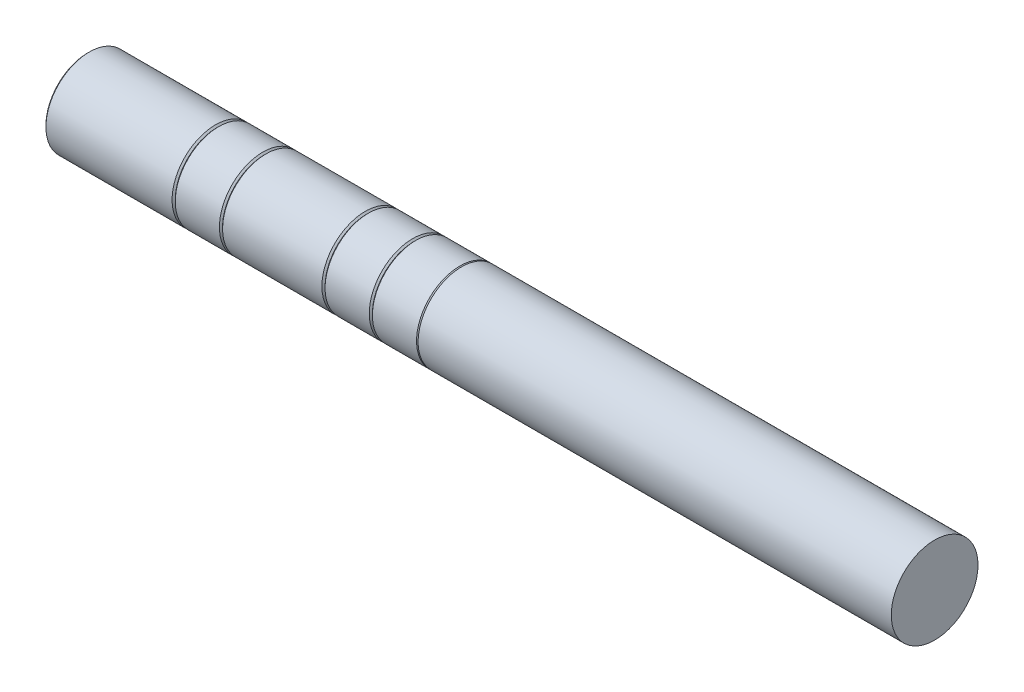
ISO-10303-21;
HEADER;
FILE_DESCRIPTION(('STEP AP214'),'2;1');
FILE_NAME('part.step','',(''),(''),'','','');
FILE_SCHEMA(('AUTOMOTIVE_DESIGN { 1 0 10303 214 1 1 1 1 }'));
ENDSEC;
DATA;
#1=APPLICATION_CONTEXT('core data for automotive mechanical design processes');
#2=APPLICATION_PROTOCOL_DEFINITION('international standard','automotive_design',2000,#1);
#3=PRODUCT_CONTEXT('',#1,'mechanical');
#4=PRODUCT('Part','Part','',(#3));
#5=PRODUCT_RELATED_PRODUCT_CATEGORY('part','',(#4));
#6=PRODUCT_DEFINITION_FORMATION('','',#4);
#7=PRODUCT_DEFINITION_CONTEXT('part definition',#1,'design');
#8=PRODUCT_DEFINITION('design','',#6,#7);
#9=PRODUCT_DEFINITION_SHAPE('','',#8);
#10=(LENGTH_UNIT() NAMED_UNIT(*) SI_UNIT(.MILLI.,.METRE.));
#11=(NAMED_UNIT(*) PLANE_ANGLE_UNIT() SI_UNIT($,.RADIAN.));
#12=(NAMED_UNIT(*) SI_UNIT($,.STERADIAN.) SOLID_ANGLE_UNIT());
#13=UNCERTAINTY_MEASURE_WITH_UNIT(LENGTH_MEASURE(1.E-05),#10,'distance_accuracy_value','');
#14=(GEOMETRIC_REPRESENTATION_CONTEXT(3) GLOBAL_UNCERTAINTY_ASSIGNED_CONTEXT((#13)) GLOBAL_UNIT_ASSIGNED_CONTEXT((#10,
#11,#12)) REPRESENTATION_CONTEXT('',''));
#15=CARTESIAN_POINT('',(0.,0.,0.));
#16=DIRECTION('',(0.,0.,1.));
#17=DIRECTION('',(1.,0.,0.));
#18=AXIS2_PLACEMENT_3D('',#15,#16,#17);
#19=CARTESIAN_POINT('',(8.2,0.,0.));
#20=DIRECTION('',(-1.,0.,0.));
#21=DIRECTION('',(0.,0.,1.));
#22=AXIS2_PLACEMENT_3D('',#19,#20,#21);
#23=CYLINDRICAL_SURFACE('',#22,2.75);
#24=CARTESIAN_POINT('',(0.0999999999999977,0.,0.));
#25=DIRECTION('',(1.,0.,0.));
#26=DIRECTION('',(0.,0.,-1.));
#27=AXIS2_PLACEMENT_3D('',#24,#25,#26);
#28=CIRCLE('',#27,2.75);
#29=CARTESIAN_POINT('',(0.0999999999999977,0.,-2.75));
#30=VERTEX_POINT('',#29);
#31=EDGE_CURVE('E40',#30,#30,#28,.T.);
#32=ORIENTED_EDGE('',*,*,#31,.T.);
#33=EDGE_LOOP('',(#32));
#34=FACE_BOUND('',#33,.T.);
#35=CARTESIAN_POINT('',(8.1,0.,0.));
#36=DIRECTION('',(1.,0.,0.));
#37=DIRECTION('',(0.,0.,-1.));
#38=AXIS2_PLACEMENT_3D('',#35,#36,#37);
#39=CIRCLE('',#38,2.75);
#40=CARTESIAN_POINT('',(8.1,0.,-2.75));
#41=VERTEX_POINT('',#40);
#42=EDGE_CURVE('E83',#41,#41,#39,.F.);
#43=ORIENTED_EDGE('',*,*,#42,.T.);
#44=EDGE_LOOP('',(#43));
#45=FACE_BOUND('',#44,.T.);
#46=ADVANCED_FACE('F33',(#34,#45),#23,.T.);
#47=CARTESIAN_POINT('',(0.,0.,0.));
#48=DIRECTION('',(1.,0.,0.));
#49=DIRECTION('',(0.,0.,-1.));
#50=AXIS2_PLACEMENT_3D('',#47,#48,#49);
#51=PLANE('',#50);
#52=CARTESIAN_POINT('',(0.,0.,0.));
#53=DIRECTION('',(1.,0.,0.));
#54=DIRECTION('',(0.,0.,-1.));
#55=AXIS2_PLACEMENT_3D('',#52,#53,#54);
#56=CIRCLE('',#55,2.65);
#57=CARTESIAN_POINT('',(0.,0.,-2.65));
#58=VERTEX_POINT('',#57);
#59=EDGE_CURVE('E10',#58,#58,#56,.F.);
#60=ORIENTED_EDGE('',*,*,#59,.T.);
#61=EDGE_LOOP('',(#60));
#62=FACE_BOUND('',#61,.T.);
#63=ADVANCED_FACE('F116',(#62),#51,.F.);
#64=CARTESIAN_POINT('',(8.2,0.,0.));
#65=DIRECTION('',(-1.,0.,0.));
#66=DIRECTION('',(0.,0.,1.));
#67=AXIS2_PLACEMENT_3D('',#64,#65,#66);
#68=CONICAL_SURFACE('',#67,2.65,0.785398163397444);
#69=ORIENTED_EDGE('',*,*,#42,.F.);
#70=EDGE_LOOP('',(#69));
#71=FACE_BOUND('',#70,.T.);
#72=CARTESIAN_POINT('',(8.2,0.,0.));
#73=DIRECTION('',(1.,0.,0.));
#74=DIRECTION('',(0.,0.,-1.));
#75=AXIS2_PLACEMENT_3D('',#72,#73,#74);
#76=CIRCLE('',#75,2.65);
#77=CARTESIAN_POINT('',(8.2,0.,-2.65));
#78=VERTEX_POINT('',#77);
#79=EDGE_CURVE('E86',#78,#78,#76,.T.);
#80=ORIENTED_EDGE('',*,*,#79,.F.);
#81=EDGE_LOOP('',(#80));
#82=FACE_BOUND('',#81,.T.);
#83=ADVANCED_FACE('F121',(#71,#82),#68,.T.);
#84=CARTESIAN_POINT('',(11.2,0.,0.));
#85=DIRECTION('',(-1.,0.,0.));
#86=DIRECTION('',(0.,0.,1.));
#87=AXIS2_PLACEMENT_3D('',#84,#85,#86);
#88=CYLINDRICAL_SURFACE('',#87,2.75);
#89=CARTESIAN_POINT('',(8.3,0.,0.));
#90=DIRECTION('',(1.,0.,0.));
#91=DIRECTION('',(0.,0.,-1.));
#92=AXIS2_PLACEMENT_3D('',#89,#90,#91);
#93=CIRCLE('',#92,2.75);
#94=CARTESIAN_POINT('',(8.3,0.,-2.75));
#95=VERTEX_POINT('',#94);
#96=EDGE_CURVE('E77',#95,#95,#93,.T.);
#97=ORIENTED_EDGE('',*,*,#96,.T.);
#98=EDGE_LOOP('',(#97));
#99=FACE_BOUND('',#98,.T.);
#100=CARTESIAN_POINT('',(11.1,0.,0.));
#101=DIRECTION('',(1.,0.,0.));
#102=DIRECTION('',(0.,0.,-1.));
#103=AXIS2_PLACEMENT_3D('',#100,#101,#102);
#104=CIRCLE('',#103,2.75);
#105=CARTESIAN_POINT('',(11.1,0.,-2.75));
#106=VERTEX_POINT('',#105);
#107=EDGE_CURVE('E80',#106,#106,#104,.F.);
#108=ORIENTED_EDGE('',*,*,#107,.T.);
#109=EDGE_LOOP('',(#108));
#110=FACE_BOUND('',#109,.T.);
#111=ADVANCED_FACE('F128',(#99,#110),#88,.T.);
#112=CARTESIAN_POINT('',(8.3,0.,0.));
#113=DIRECTION('',(1.,0.,0.));
#114=DIRECTION('',(0.,0.,-1.));
#115=AXIS2_PLACEMENT_3D('',#112,#113,#114);
#116=CONICAL_SURFACE('',#115,2.75,0.785398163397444);
#117=ORIENTED_EDGE('',*,*,#79,.T.);
#118=EDGE_LOOP('',(#117));
#119=FACE_BOUND('',#118,.T.);
#120=ORIENTED_EDGE('',*,*,#96,.F.);
#121=EDGE_LOOP('',(#120));
#122=FACE_BOUND('',#121,.T.);
#123=ADVANCED_FACE('F130',(#119,#122),#116,.T.);
#124=CARTESIAN_POINT('',(11.2,0.,0.));
#125=DIRECTION('',(-1.,0.,0.));
#126=DIRECTION('',(0.,0.,1.));
#127=AXIS2_PLACEMENT_3D('',#124,#125,#126);
#128=CONICAL_SURFACE('',#127,2.65,0.785398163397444);
#129=ORIENTED_EDGE('',*,*,#107,.F.);
#130=EDGE_LOOP('',(#129));
#131=FACE_BOUND('',#130,.T.);
#132=CARTESIAN_POINT('',(11.2,0.,0.));
#133=DIRECTION('',(1.,0.,0.));
#134=DIRECTION('',(0.,0.,-1.));
#135=AXIS2_PLACEMENT_3D('',#132,#133,#134);
#136=CIRCLE('',#135,2.65);
#137=CARTESIAN_POINT('',(11.2,0.,-2.65));
#138=VERTEX_POINT('',#137);
#139=EDGE_CURVE('E74',#138,#138,#136,.T.);
#140=ORIENTED_EDGE('',*,*,#139,.F.);
#141=EDGE_LOOP('',(#140));
#142=FACE_BOUND('',#141,.T.);
#143=ADVANCED_FACE('F133',(#131,#142),#128,.T.);
#144=CARTESIAN_POINT('',(17.7,0.,0.));
#145=DIRECTION('',(-1.,0.,0.));
#146=DIRECTION('',(0.,0.,1.));
#147=AXIS2_PLACEMENT_3D('',#144,#145,#146);
#148=CYLINDRICAL_SURFACE('',#147,2.75);
#149=CARTESIAN_POINT('',(11.3,0.,0.));
#150=DIRECTION('',(1.,0.,0.));
#151=DIRECTION('',(0.,0.,-1.));
#152=AXIS2_PLACEMENT_3D('',#149,#150,#151);
#153=CIRCLE('',#152,2.75);
#154=CARTESIAN_POINT('',(11.3,0.,2.75));
#155=VERTEX_POINT('',#154);
#156=EDGE_CURVE('E68',#155,#155,#153,.T.);
#157=CARTESIAN_POINT('',(17.6,0.,0.));
#158=DIRECTION('',(1.,0.,0.));
#159=DIRECTION('',(0.,0.,-1.));
#160=AXIS2_PLACEMENT_3D('',#157,#158,#159);
#161=CIRCLE('',#160,2.75);
#162=CARTESIAN_POINT('',(17.6,0.,2.75));
#163=VERTEX_POINT('',#162);
#164=EDGE_CURVE('E71',#163,#163,#161,.F.);
#165=CARTESIAN_POINT('',(11.3,0.,2.75));
#166=CARTESIAN_POINT('',(11.365625,0.,2.75));
#167=CARTESIAN_POINT('',(11.43125,0.,2.75));
#168=CARTESIAN_POINT('',(11.5625,0.,2.75));
#169=CARTESIAN_POINT('',(11.628125,0.,2.75));
#170=CARTESIAN_POINT('',(11.759375,0.,2.75));
#171=CARTESIAN_POINT('',(11.825,0.,2.75));
#172=CARTESIAN_POINT('',(11.95625,0.,2.75));
#173=CARTESIAN_POINT('',(12.021875,0.,2.75));
#174=CARTESIAN_POINT('',(12.153125,0.,2.75));
#175=CARTESIAN_POINT('',(12.21875,0.,2.75));
#176=CARTESIAN_POINT('',(12.35,0.,2.75));
#177=CARTESIAN_POINT('',(12.415625,0.,2.75));
#178=CARTESIAN_POINT('',(12.546875,0.,2.75));
#179=CARTESIAN_POINT('',(12.6125,0.,2.75));
#180=CARTESIAN_POINT('',(12.74375,0.,2.75));
#181=CARTESIAN_POINT('',(12.809375,0.,2.75));
#182=CARTESIAN_POINT('',(12.940625,0.,2.75));
#183=CARTESIAN_POINT('',(13.00625,0.,2.75));
#184=CARTESIAN_POINT('',(13.1375,0.,2.75));
#185=CARTESIAN_POINT('',(13.203125,0.,2.75));
#186=CARTESIAN_POINT('',(13.334375,0.,2.75));
#187=CARTESIAN_POINT('',(13.4,0.,2.75));
#188=CARTESIAN_POINT('',(13.53125,0.,2.75));
#189=CARTESIAN_POINT('',(13.596875,0.,2.75));
#190=CARTESIAN_POINT('',(13.728125,0.,2.75));
#191=CARTESIAN_POINT('',(13.79375,0.,2.75));
#192=CARTESIAN_POINT('',(13.925,0.,2.75));
#193=CARTESIAN_POINT('',(13.990625,0.,2.75));
#194=CARTESIAN_POINT('',(14.121875,0.,2.75));
#195=CARTESIAN_POINT('',(14.1875,0.,2.75));
#196=CARTESIAN_POINT('',(14.31875,0.,2.75));
#197=CARTESIAN_POINT('',(14.384375,0.,2.75));
#198=CARTESIAN_POINT('',(14.515625,0.,2.75));
#199=CARTESIAN_POINT('',(14.58125,0.,2.75));
#200=CARTESIAN_POINT('',(14.7125,0.,2.75));
#201=CARTESIAN_POINT('',(14.778125,0.,2.75));
#202=CARTESIAN_POINT('',(14.909375,0.,2.75));
#203=CARTESIAN_POINT('',(14.975,0.,2.75));
#204=CARTESIAN_POINT('',(15.10625,0.,2.75));
#205=CARTESIAN_POINT('',(15.171875,0.,2.75));
#206=CARTESIAN_POINT('',(15.303125,0.,2.75));
#207=CARTESIAN_POINT('',(15.36875,0.,2.75));
#208=CARTESIAN_POINT('',(15.5,0.,2.75));
#209=CARTESIAN_POINT('',(15.565625,0.,2.75));
#210=CARTESIAN_POINT('',(15.696875,0.,2.75));
#211=CARTESIAN_POINT('',(15.7625,0.,2.75));
#212=CARTESIAN_POINT('',(15.89375,0.,2.75));
#213=CARTESIAN_POINT('',(15.959375,0.,2.75));
#214=CARTESIAN_POINT('',(16.090625,0.,2.75));
#215=CARTESIAN_POINT('',(16.15625,0.,2.75));
#216=CARTESIAN_POINT('',(16.2875,0.,2.75));
#217=CARTESIAN_POINT('',(16.353125,0.,2.75));
#218=CARTESIAN_POINT('',(16.484375,0.,2.75));
#219=CARTESIAN_POINT('',(16.55,0.,2.75));
#220=CARTESIAN_POINT('',(16.68125,0.,2.75));
#221=CARTESIAN_POINT('',(16.746875,0.,2.75));
#222=CARTESIAN_POINT('',(16.878125,0.,2.75));
#223=CARTESIAN_POINT('',(16.94375,0.,2.75));
#224=CARTESIAN_POINT('',(17.075,0.,2.75));
#225=CARTESIAN_POINT('',(17.140625,0.,2.75));
#226=CARTESIAN_POINT('',(17.271875,0.,2.75));
#227=CARTESIAN_POINT('',(17.3375,0.,2.75));
#228=CARTESIAN_POINT('',(17.46875,0.,2.75));
#229=CARTESIAN_POINT('',(17.534375,0.,2.75));
#230=CARTESIAN_POINT('',(17.6,0.,2.75));
#231=B_SPLINE_CURVE_WITH_KNOTS('',3,(#165,#166,#167,#168,#169,#170,#171,#172,#173,#174,#175,
#176,#177,#178,#179,#180,#181,#182,#183,#184,#185,#186,#187,#188,#189,#190,#191,#192,#193,#194,
#195,#196,#197,#198,#199,#200,#201,#202,#203,#204,#205,#206,#207,#208,#209,#210,#211,#212,#213,
#214,#215,#216,#217,#218,#219,#220,#221,#222,#223,#224,#225,#226,#227,#228,#229,#230),
.UNSPECIFIED.,.F.,.F.,(4,2,2,2,2,2,2,2,2,2,2,2,2,2,2,2,2,2,2,2,2,2,2,2,2,2,2,2,2,2,2,2,4),(0.,
0.196875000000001,0.393750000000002,0.590625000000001,0.7875,0.984374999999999,1.18125,1.378125,
1.575,1.771875,1.96875,2.165625,2.3625,2.559375,2.75625,2.953125,3.15,3.346875,3.54375,3.740625,
3.9375,4.134375,4.33125,4.528125,4.725,4.921875,5.11875,5.315625,5.5125,5.709375,
5.90624999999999,6.10312499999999,6.3),.UNSPECIFIED.);
#232=EDGE_CURVE('BSEAM137',#155,#163,#231,.T.);
#233=ORIENTED_EDGE('',*,*,#156,.T.);
#234=ORIENTED_EDGE('',*,*,#164,.T.);
#235=ORIENTED_EDGE('',*,*,#232,.T.);
#236=ORIENTED_EDGE('',*,*,#232,.F.);
#237=EDGE_LOOP('',(#233,#235,#234,#236));
#238=FACE_BOUND('',#237,.T.);
#239=ADVANCED_FACE('F137',(#238),#148,.T.);
#240=CARTESIAN_POINT('',(11.3,0.,0.));
#241=DIRECTION('',(1.,0.,0.));
#242=DIRECTION('',(0.,0.,-1.));
#243=AXIS2_PLACEMENT_3D('',#240,#241,#242);
#244=CONICAL_SURFACE('',#243,2.75,0.785398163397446);
#245=ORIENTED_EDGE('',*,*,#139,.T.);
#246=EDGE_LOOP('',(#245));
#247=FACE_BOUND('',#246,.T.);
#248=ORIENTED_EDGE('',*,*,#156,.F.);
#249=EDGE_LOOP('',(#248));
#250=FACE_BOUND('',#249,.T.);
#251=ADVANCED_FACE('F139',(#247,#250),#244,.T.);
#252=CARTESIAN_POINT('',(17.7,0.,0.));
#253=DIRECTION('',(-1.,0.,0.));
#254=DIRECTION('',(0.,0.,1.));
#255=AXIS2_PLACEMENT_3D('',#252,#253,#254);
#256=CONICAL_SURFACE('',#255,2.65000000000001,0.785398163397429);
#257=ORIENTED_EDGE('',*,*,#164,.F.);
#258=EDGE_LOOP('',(#257));
#259=FACE_BOUND('',#258,.T.);
#260=CARTESIAN_POINT('',(17.7,0.,0.));
#261=DIRECTION('',(1.,0.,0.));
#262=DIRECTION('',(0.,0.,-1.));
#263=AXIS2_PLACEMENT_3D('',#260,#261,#262);
#264=CIRCLE('',#263,2.65000000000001);
#265=CARTESIAN_POINT('',(17.7,0.,-2.65000000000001));
#266=VERTEX_POINT('',#265);
#267=EDGE_CURVE('E65',#266,#266,#264,.T.);
#268=ORIENTED_EDGE('',*,*,#267,.F.);
#269=EDGE_LOOP('',(#268));
#270=FACE_BOUND('',#269,.T.);
#271=ADVANCED_FACE('F142',(#259,#270),#256,.T.);
#272=CARTESIAN_POINT('',(20.7,0.,0.));
#273=DIRECTION('',(-1.,0.,0.));
#274=DIRECTION('',(0.,0.,1.));
#275=AXIS2_PLACEMENT_3D('',#272,#273,#274);
#276=CYLINDRICAL_SURFACE('',#275,2.75);
#277=CARTESIAN_POINT('',(17.8,0.,0.));
#278=DIRECTION('',(1.,0.,0.));
#279=DIRECTION('',(0.,0.,-1.));
#280=AXIS2_PLACEMENT_3D('',#277,#278,#279);
#281=CIRCLE('',#280,2.75);
#282=CARTESIAN_POINT('',(17.8,0.,-2.75));
#283=VERTEX_POINT('',#282);
#284=EDGE_CURVE('E59',#283,#283,#281,.T.);
#285=ORIENTED_EDGE('',*,*,#284,.T.);
#286=EDGE_LOOP('',(#285));
#287=FACE_BOUND('',#286,.T.);
#288=CARTESIAN_POINT('',(20.6,0.,0.));
#289=DIRECTION('',(1.,0.,0.));
#290=DIRECTION('',(0.,0.,-1.));
#291=AXIS2_PLACEMENT_3D('',#288,#289,#290);
#292=CIRCLE('',#291,2.75);
#293=CARTESIAN_POINT('',(20.6,0.,-2.75));
#294=VERTEX_POINT('',#293);
#295=EDGE_CURVE('E62',#294,#294,#292,.F.);
#296=ORIENTED_EDGE('',*,*,#295,.T.);
#297=EDGE_LOOP('',(#296));
#298=FACE_BOUND('',#297,.T.);
#299=ADVANCED_FACE('F146',(#287,#298),#276,.T.);
#300=CARTESIAN_POINT('',(17.8,0.,0.));
#301=DIRECTION('',(1.,0.,0.));
#302=DIRECTION('',(0.,0.,-1.));
#303=AXIS2_PLACEMENT_3D('',#300,#301,#302);
#304=CONICAL_SURFACE('',#303,2.75,0.785398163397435);
#305=ORIENTED_EDGE('',*,*,#267,.T.);
#306=EDGE_LOOP('',(#305));
#307=FACE_BOUND('',#306,.T.);
#308=ORIENTED_EDGE('',*,*,#284,.F.);
#309=EDGE_LOOP('',(#308));
#310=FACE_BOUND('',#309,.T.);
#311=ADVANCED_FACE('F148',(#307,#310),#304,.T.);
#312=CARTESIAN_POINT('',(20.7,0.,0.));
#313=DIRECTION('',(-1.,0.,0.));
#314=DIRECTION('',(0.,0.,1.));
#315=AXIS2_PLACEMENT_3D('',#312,#313,#314);
#316=CONICAL_SURFACE('',#315,2.65,0.785398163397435);
#317=ORIENTED_EDGE('',*,*,#295,.F.);
#318=EDGE_LOOP('',(#317));
#319=FACE_BOUND('',#318,.T.);
#320=CARTESIAN_POINT('',(20.7,0.,0.));
#321=DIRECTION('',(1.,0.,0.));
#322=DIRECTION('',(0.,0.,-1.));
#323=AXIS2_PLACEMENT_3D('',#320,#321,#322);
#324=CIRCLE('',#323,2.65);
#325=CARTESIAN_POINT('',(20.7,0.,-2.65));
#326=VERTEX_POINT('',#325);
#327=EDGE_CURVE('E56',#326,#326,#324,.T.);
#328=ORIENTED_EDGE('',*,*,#327,.F.);
#329=EDGE_LOOP('',(#328));
#330=FACE_BOUND('',#329,.T.);
#331=ADVANCED_FACE('F151',(#319,#330),#316,.T.);
#332=CARTESIAN_POINT('',(23.7,0.,0.));
#333=DIRECTION('',(-1.,0.,0.));
#334=DIRECTION('',(0.,0.,1.));
#335=AXIS2_PLACEMENT_3D('',#332,#333,#334);
#336=CYLINDRICAL_SURFACE('',#335,2.75);
#337=CARTESIAN_POINT('',(20.8,0.,0.));
#338=DIRECTION('',(1.,0.,0.));
#339=DIRECTION('',(0.,0.,-1.));
#340=AXIS2_PLACEMENT_3D('',#337,#338,#339);
#341=CIRCLE('',#340,2.75);
#342=CARTESIAN_POINT('',(20.8,0.,-2.75));
#343=VERTEX_POINT('',#342);
#344=EDGE_CURVE('E48',#343,#343,#341,.T.);
#345=ORIENTED_EDGE('',*,*,#344,.T.);
#346=EDGE_LOOP('',(#345));
#347=FACE_BOUND('',#346,.T.);
#348=CARTESIAN_POINT('',(23.6,0.,0.));
#349=DIRECTION('',(1.,0.,0.));
#350=DIRECTION('',(0.,0.,-1.));
#351=AXIS2_PLACEMENT_3D('',#348,#349,#350);
#352=CIRCLE('',#351,2.75);
#353=CARTESIAN_POINT('',(23.6,0.,-2.75));
#354=VERTEX_POINT('',#353);
#355=EDGE_CURVE('E53',#354,#354,#352,.F.);
#356=ORIENTED_EDGE('',*,*,#355,.T.);
#357=EDGE_LOOP('',(#356));
#358=FACE_BOUND('',#357,.T.);
#359=ADVANCED_FACE('F155',(#347,#358),#336,.T.);
#360=CARTESIAN_POINT('',(20.8,0.,0.));
#361=DIRECTION('',(1.,0.,0.));
#362=DIRECTION('',(0.,0.,-1.));
#363=AXIS2_PLACEMENT_3D('',#360,#361,#362);
#364=CONICAL_SURFACE('',#363,2.75,0.785398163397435);
#365=ORIENTED_EDGE('',*,*,#327,.T.);
#366=EDGE_LOOP('',(#365));
#367=FACE_BOUND('',#366,.T.);
#368=ORIENTED_EDGE('',*,*,#344,.F.);
#369=EDGE_LOOP('',(#368));
#370=FACE_BOUND('',#369,.T.);
#371=ADVANCED_FACE('F157',(#367,#370),#364,.T.);
#372=CARTESIAN_POINT('',(23.7,0.,0.));
#373=DIRECTION('',(-1.,0.,0.));
#374=DIRECTION('',(0.,0.,1.));
#375=AXIS2_PLACEMENT_3D('',#372,#373,#374);
#376=CONICAL_SURFACE('',#375,2.65,0.785398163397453);
#377=ORIENTED_EDGE('',*,*,#355,.F.);
#378=EDGE_LOOP('',(#377));
#379=FACE_BOUND('',#378,.T.);
#380=CARTESIAN_POINT('',(23.7,0.,0.));
#381=DIRECTION('',(1.,0.,0.));
#382=DIRECTION('',(0.,0.,-1.));
#383=AXIS2_PLACEMENT_3D('',#380,#381,#382);
#384=CIRCLE('',#383,2.65);
#385=CARTESIAN_POINT('',(23.7,0.,-2.65));
#386=VERTEX_POINT('',#385);
#387=EDGE_CURVE('E44',#386,#386,#384,.T.);
#388=ORIENTED_EDGE('',*,*,#387,.F.);
#389=EDGE_LOOP('',(#388));
#390=FACE_BOUND('',#389,.T.);
#391=ADVANCED_FACE('F101',(#379,#390),#376,.T.);
#392=CARTESIAN_POINT('',(53.7,0.,0.));
#393=DIRECTION('',(-1.,0.,0.));
#394=DIRECTION('',(0.,0.,1.));
#395=AXIS2_PLACEMENT_3D('',#392,#393,#394);
#396=CYLINDRICAL_SURFACE('',#395,2.75);
#397=CARTESIAN_POINT('',(53.7,0.,0.));
#398=DIRECTION('',(1.,0.,0.));
#399=DIRECTION('',(0.,0.,-1.));
#400=AXIS2_PLACEMENT_3D('',#397,#398,#399);
#401=CIRCLE('',#400,2.75);
#402=CARTESIAN_POINT('',(53.7,0.,-2.75));
#403=VERTEX_POINT('',#402);
#404=EDGE_CURVE('E89',#403,#403,#401,.T.);
#405=ORIENTED_EDGE('',*,*,#404,.F.);
#406=EDGE_LOOP('',(#405));
#407=FACE_BOUND('',#406,.T.);
#408=CARTESIAN_POINT('',(23.7,0.,0.));
#409=DIRECTION('',(1.,0.,0.));
#410=DIRECTION('',(0.,0.,-1.));
#411=AXIS2_PLACEMENT_3D('',#408,#409,#410);
#412=CIRCLE('',#411,2.75);
#413=CARTESIAN_POINT('',(23.7,0.,-2.75));
#414=VERTEX_POINT('',#413);
#415=EDGE_CURVE('E90',#414,#414,#412,.T.);
#416=ORIENTED_EDGE('',*,*,#415,.T.);
#417=EDGE_LOOP('',(#416));
#418=FACE_BOUND('',#417,.T.);
#419=ADVANCED_FACE('F98',(#407,#418),#396,.T.);
#420=CARTESIAN_POINT('',(53.7,0.,0.));
#421=DIRECTION('',(1.,0.,0.));
#422=DIRECTION('',(0.,0.,-1.));
#423=AXIS2_PLACEMENT_3D('',#420,#421,#422);
#424=PLANE('',#423);
#425=ORIENTED_EDGE('',*,*,#404,.T.);
#426=EDGE_LOOP('',(#425));
#427=FACE_BOUND('',#426,.T.);
#428=ADVANCED_FACE('F96',(#427),#424,.T.);
#429=CARTESIAN_POINT('',(23.7,0.,0.));
#430=DIRECTION('',(1.,0.,0.));
#431=DIRECTION('',(0.,0.,-1.));
#432=AXIS2_PLACEMENT_3D('',#429,#430,#431);
#433=PLANE('',#432);
#434=ORIENTED_EDGE('',*,*,#387,.T.);
#435=EDGE_LOOP('',(#434));
#436=FACE_BOUND('',#435,.T.);
#437=ORIENTED_EDGE('',*,*,#415,.F.);
#438=EDGE_LOOP('',(#437));
#439=FACE_BOUND('',#438,.T.);
#440=ADVANCED_FACE('F105',(#436,#439),#433,.F.);
#441=CARTESIAN_POINT('',(0.0999999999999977,0.,0.));
#442=DIRECTION('',(1.,0.,0.));
#443=DIRECTION('',(0.,0.,-1.));
#444=AXIS2_PLACEMENT_3D('',#441,#442,#443);
#445=CONICAL_SURFACE('',#444,2.75,0.785398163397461);
#446=ORIENTED_EDGE('',*,*,#59,.F.);
#447=EDGE_LOOP('',(#446));
#448=FACE_BOUND('',#447,.T.);
#449=ORIENTED_EDGE('',*,*,#31,.F.);
#450=EDGE_LOOP('',(#449));
#451=FACE_BOUND('',#450,.T.);
#452=ADVANCED_FACE('F35',(#448,#451),#445,.T.);
#453=CLOSED_SHELL('',(#46,#63,#83,#111,#123,#143,#239,#251,#271,#299,#311,#331,#359,#371,#391,
#419,#428,#440,#452));
#454=MANIFOLD_SOLID_BREP('B2',#453);
#455=ADVANCED_BREP_SHAPE_REPRESENTATION('',(#18,#454),#14);
#456=SHAPE_DEFINITION_REPRESENTATION(#9,#455);
ENDSEC;
END-ISO-10303-21;
